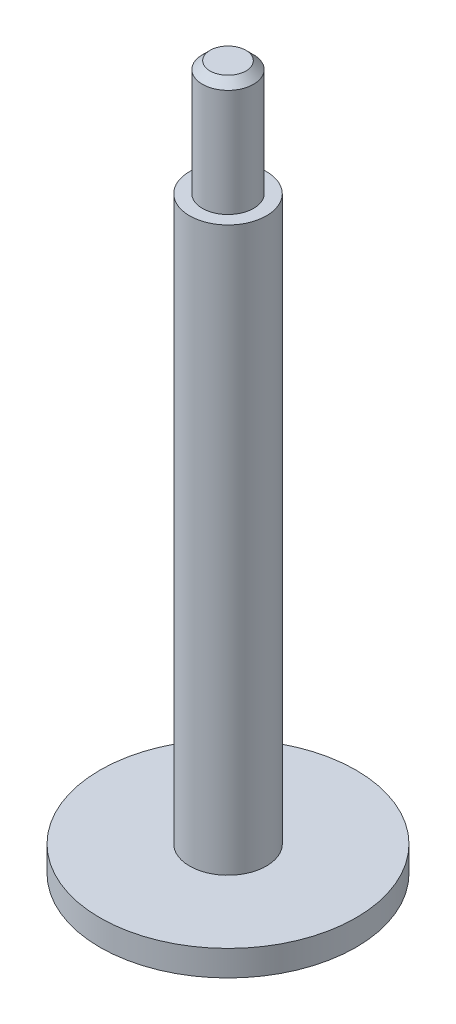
from build123d import *

# Parameters (mm, degrees)
CHANFREIN1_SIZE = 0.3


with BuildPart() as part:
    # Esquisse1 → R_volution1 (revolve)
    with BuildSketch(Plane.XY, mode=Mode.PRIVATE) as r_volution1_sk:
        Polygon((0, 27.5), (0, 0), (-5, 0), (-5, 1), (-1.5, 1), (-1.5, 23), (-1, 23), (-1, 27.5), align=None)
    revolve(r_volution1_sk.sketch.rotate(Axis((0, 0, 0), (0, -1, 0)), 270), axis=Axis((0, 0, 0), (0, -1, 0)))

    # Chanfrein1
    chanfrein1_edges = [part.edges().sort_by_distance(p)[0] for p in [
        (0, 27.5, -1),
    ]]
    chamfer(chanfrein1_edges, length=CHANFREIN1_SIZE)


solid = part.part
